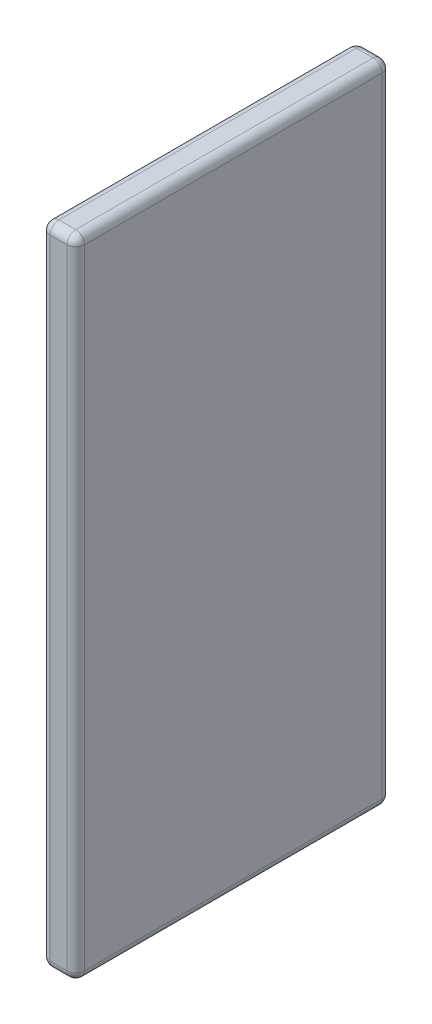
ISO-10303-21;
HEADER;
FILE_DESCRIPTION(('STEP AP214'),'2;1');
FILE_NAME('part.step','',(''),(''),'','','');
FILE_SCHEMA(('AUTOMOTIVE_DESIGN { 1 0 10303 214 1 1 1 1 }'));
ENDSEC;
DATA;
#1=APPLICATION_CONTEXT('core data for automotive mechanical design processes');
#2=APPLICATION_PROTOCOL_DEFINITION('international standard','automotive_design',2000,#1);
#3=PRODUCT_CONTEXT('',#1,'mechanical');
#4=PRODUCT('Part','Part','',(#3));
#5=PRODUCT_RELATED_PRODUCT_CATEGORY('part','',(#4));
#6=PRODUCT_DEFINITION_FORMATION('','',#4);
#7=PRODUCT_DEFINITION_CONTEXT('part definition',#1,'design');
#8=PRODUCT_DEFINITION('design','',#6,#7);
#9=PRODUCT_DEFINITION_SHAPE('','',#8);
#10=(LENGTH_UNIT() NAMED_UNIT(*) SI_UNIT(.MILLI.,.METRE.));
#11=(NAMED_UNIT(*) PLANE_ANGLE_UNIT() SI_UNIT($,.RADIAN.));
#12=(NAMED_UNIT(*) SI_UNIT($,.STERADIAN.) SOLID_ANGLE_UNIT());
#13=UNCERTAINTY_MEASURE_WITH_UNIT(LENGTH_MEASURE(1.E-05),#10,'distance_accuracy_value','');
#14=(GEOMETRIC_REPRESENTATION_CONTEXT(3) GLOBAL_UNCERTAINTY_ASSIGNED_CONTEXT((#13)) GLOBAL_UNIT_ASSIGNED_CONTEXT((#10,
#11,#12)) REPRESENTATION_CONTEXT('',''));
#15=CARTESIAN_POINT('',(0.,0.,0.));
#16=DIRECTION('',(0.,0.,1.));
#17=DIRECTION('',(1.,0.,0.));
#18=AXIS2_PLACEMENT_3D('',#15,#16,#17);
#19=CARTESIAN_POINT('',(7.8,0.,0.));
#20=DIRECTION('',(0.,0.,-1.));
#21=DIRECTION('',(-1.,0.,0.));
#22=AXIS2_PLACEMENT_3D('',#19,#20,#21);
#23=PLANE('',#22);
#24=DIRECTION('',(-1.,0.,0.));
#25=VECTOR('',#24,1.);
#26=CARTESIAN_POINT('',(7.8,2.,0.));
#27=LINE('',#26,#25);
#28=CARTESIAN_POINT('',(2.,2.,0.));
#29=VERTEX_POINT('',#28);
#30=CARTESIAN_POINT('',(5.8,2.,0.));
#31=VERTEX_POINT('',#30);
#32=EDGE_CURVE('E208',#29,#31,#27,.F.);
#33=ORIENTED_EDGE('',*,*,#32,.T.);
#34=DIRECTION('',(0.,-1.,0.));
#35=VECTOR('',#34,1.);
#36=CARTESIAN_POINT('',(5.8,0.,0.));
#37=LINE('',#36,#35);
#38=CARTESIAN_POINT('',(5.8,144.7,0.));
#39=VERTEX_POINT('',#38);
#40=EDGE_CURVE('E45',#31,#39,#37,.F.);
#41=ORIENTED_EDGE('',*,*,#40,.T.);
#42=DIRECTION('',(-1.,0.,0.));
#43=VECTOR('',#42,1.);
#44=CARTESIAN_POINT('',(7.8,144.7,0.));
#45=LINE('',#44,#43);
#46=CARTESIAN_POINT('',(2.,144.7,0.));
#47=VERTEX_POINT('',#46);
#48=EDGE_CURVE('E280',#39,#47,#45,.T.);
#49=ORIENTED_EDGE('',*,*,#48,.T.);
#50=DIRECTION('',(0.,-1.,0.));
#51=VECTOR('',#50,1.);
#52=CARTESIAN_POINT('',(2.,2.,0.));
#53=LINE('',#52,#51);
#54=EDGE_CURVE('E238',#47,#29,#53,.T.);
#55=ORIENTED_EDGE('',*,*,#54,.T.);
#56=EDGE_LOOP('',(#33,#41,#49,#55));
#57=FACE_BOUND('',#56,.T.);
#58=ADVANCED_FACE('F36',(#57),#23,.F.);
#59=CARTESIAN_POINT('',(7.8,0.,0.));
#60=DIRECTION('',(0.,1.,0.));
#61=DIRECTION('',(0.,0.,1.));
#62=AXIS2_PLACEMENT_3D('',#59,#60,#61);
#63=PLANE('',#62);
#64=DIRECTION('',(-1.,0.,0.));
#65=VECTOR('',#64,1.);
#66=CARTESIAN_POINT('',(7.8,0.,-69.5));
#67=LINE('',#66,#65);
#68=CARTESIAN_POINT('',(2.,0.,-69.5));
#69=VERTEX_POINT('',#68);
#70=CARTESIAN_POINT('',(5.8,0.,-69.5));
#71=VERTEX_POINT('',#70);
#72=EDGE_CURVE('E179',#69,#71,#67,.F.);
#73=ORIENTED_EDGE('',*,*,#72,.T.);
#74=DIRECTION('',(0.,0.,-1.));
#75=VECTOR('',#74,1.);
#76=CARTESIAN_POINT('',(5.8,0.,0.));
#77=LINE('',#76,#75);
#78=CARTESIAN_POINT('',(5.8,0.,-2.));
#79=VERTEX_POINT('',#78);
#80=EDGE_CURVE('E205',#71,#79,#77,.F.);
#81=ORIENTED_EDGE('',*,*,#80,.T.);
#82=DIRECTION('',(-1.,0.,0.));
#83=VECTOR('',#82,1.);
#84=CARTESIAN_POINT('',(7.8,0.,-2.));
#85=LINE('',#84,#83);
#86=CARTESIAN_POINT('',(2.,0.,-2.));
#87=VERTEX_POINT('',#86);
#88=EDGE_CURVE('E202',#79,#87,#85,.T.);
#89=ORIENTED_EDGE('',*,*,#88,.T.);
#90=DIRECTION('',(0.,0.,-1.));
#91=VECTOR('',#90,1.);
#92=CARTESIAN_POINT('',(2.,0.,-69.5));
#93=LINE('',#92,#91);
#94=EDGE_CURVE('E200',#87,#69,#93,.T.);
#95=ORIENTED_EDGE('',*,*,#94,.T.);
#96=EDGE_LOOP('',(#73,#81,#89,#95));
#97=FACE_BOUND('',#96,.T.);
#98=ADVANCED_FACE('F261',(#97),#63,.F.);
#99=CARTESIAN_POINT('',(7.8,0.,-71.5));
#100=DIRECTION('',(0.,0.,1.));
#101=DIRECTION('',(1.,0.,0.));
#102=AXIS2_PLACEMENT_3D('',#99,#100,#101);
#103=PLANE('',#102);
#104=DIRECTION('',(-1.,0.,0.));
#105=VECTOR('',#104,1.);
#106=CARTESIAN_POINT('',(7.8,144.7,-71.5));
#107=LINE('',#106,#105);
#108=CARTESIAN_POINT('',(2.,144.7,-71.5));
#109=VERTEX_POINT('',#108);
#110=CARTESIAN_POINT('',(5.8,144.7,-71.5));
#111=VERTEX_POINT('',#110);
#112=EDGE_CURVE('E136',#109,#111,#107,.F.);
#113=ORIENTED_EDGE('',*,*,#112,.T.);
#114=DIRECTION('',(0.,1.,0.));
#115=VECTOR('',#114,1.);
#116=CARTESIAN_POINT('',(5.8,0.,-71.5));
#117=LINE('',#116,#115);
#118=CARTESIAN_POINT('',(5.8,2.,-71.5));
#119=VERTEX_POINT('',#118);
#120=EDGE_CURVE('E176',#111,#119,#117,.F.);
#121=ORIENTED_EDGE('',*,*,#120,.T.);
#122=DIRECTION('',(-1.,0.,0.));
#123=VECTOR('',#122,1.);
#124=CARTESIAN_POINT('',(7.8,2.,-71.5));
#125=LINE('',#124,#123);
#126=CARTESIAN_POINT('',(2.,2.,-71.5));
#127=VERTEX_POINT('',#126);
#128=EDGE_CURVE('E169',#119,#127,#125,.T.);
#129=ORIENTED_EDGE('',*,*,#128,.T.);
#130=DIRECTION('',(0.,1.,0.));
#131=VECTOR('',#130,1.);
#132=CARTESIAN_POINT('',(2.,144.7,-71.5));
#133=LINE('',#132,#131);
#134=EDGE_CURVE('E166',#127,#109,#133,.T.);
#135=ORIENTED_EDGE('',*,*,#134,.T.);
#136=EDGE_LOOP('',(#113,#121,#129,#135));
#137=FACE_BOUND('',#136,.T.);
#138=ADVANCED_FACE('F275',(#137),#103,.F.);
#139=CARTESIAN_POINT('',(7.8,146.7,0.));
#140=DIRECTION('',(0.,-1.,0.));
#141=DIRECTION('',(0.,0.,-1.));
#142=AXIS2_PLACEMENT_3D('',#139,#140,#141);
#143=PLANE('',#142);
#144=DIRECTION('',(0.,0.,1.));
#145=VECTOR('',#144,1.);
#146=CARTESIAN_POINT('',(5.8,146.7,0.));
#147=LINE('',#146,#145);
#148=CARTESIAN_POINT('',(5.8,146.7,-2.));
#149=VERTEX_POINT('',#148);
#150=CARTESIAN_POINT('',(5.8,146.7,-69.5));
#151=VERTEX_POINT('',#150);
#152=EDGE_CURVE('E162',#149,#151,#147,.F.);
#153=ORIENTED_EDGE('',*,*,#152,.T.);
#154=DIRECTION('',(-1.,0.,0.));
#155=VECTOR('',#154,1.);
#156=CARTESIAN_POINT('',(7.8,146.7,-69.5));
#157=LINE('',#156,#155);
#158=CARTESIAN_POINT('',(2.,146.7,-69.5));
#159=VERTEX_POINT('',#158);
#160=EDGE_CURVE('E133',#151,#159,#157,.T.);
#161=ORIENTED_EDGE('',*,*,#160,.T.);
#162=DIRECTION('',(0.,0.,1.));
#163=VECTOR('',#162,1.);
#164=CARTESIAN_POINT('',(2.,146.7,0.));
#165=LINE('',#164,#163);
#166=CARTESIAN_POINT('',(2.,146.7,-2.));
#167=VERTEX_POINT('',#166);
#168=EDGE_CURVE('E148',#159,#167,#165,.T.);
#169=ORIENTED_EDGE('',*,*,#168,.T.);
#170=DIRECTION('',(-1.,0.,0.));
#171=VECTOR('',#170,1.);
#172=CARTESIAN_POINT('',(7.8,146.7,-2.));
#173=LINE('',#172,#171);
#174=EDGE_CURVE('E156',#167,#149,#173,.F.);
#175=ORIENTED_EDGE('',*,*,#174,.T.);
#176=EDGE_LOOP('',(#153,#161,#169,#175));
#177=FACE_BOUND('',#176,.T.);
#178=ADVANCED_FACE('F160',(#177),#143,.F.);
#179=CARTESIAN_POINT('',(7.8,0.,0.));
#180=DIRECTION('',(-1.,0.,0.));
#181=DIRECTION('',(0.,0.,1.));
#182=AXIS2_PLACEMENT_3D('',#179,#180,#181);
#183=PLANE('',#182);
#184=DIRECTION('',(0.,0.,1.));
#185=VECTOR('',#184,1.);
#186=CARTESIAN_POINT('',(7.8,144.7,0.));
#187=LINE('',#186,#185);
#188=CARTESIAN_POINT('',(7.8,144.7,-69.5));
#189=VERTEX_POINT('',#188);
#190=CARTESIAN_POINT('',(7.8,144.7,-2.));
#191=VERTEX_POINT('',#190);
#192=EDGE_CURVE('E283',#189,#191,#187,.T.);
#193=ORIENTED_EDGE('',*,*,#192,.T.);
#194=DIRECTION('',(0.,-1.,0.));
#195=VECTOR('',#194,1.);
#196=CARTESIAN_POINT('',(7.8,0.,-2.));
#197=LINE('',#196,#195);
#198=CARTESIAN_POINT('',(7.8,2.,-2.));
#199=VERTEX_POINT('',#198);
#200=EDGE_CURVE('E236',#191,#199,#197,.T.);
#201=ORIENTED_EDGE('',*,*,#200,.T.);
#202=DIRECTION('',(0.,0.,-1.));
#203=VECTOR('',#202,1.);
#204=CARTESIAN_POINT('',(7.8,2.,0.));
#205=LINE('',#204,#203);
#206=CARTESIAN_POINT('',(7.8,2.,-69.5));
#207=VERTEX_POINT('',#206);
#208=EDGE_CURVE('E211',#199,#207,#205,.T.);
#209=ORIENTED_EDGE('',*,*,#208,.T.);
#210=DIRECTION('',(0.,1.,0.));
#211=VECTOR('',#210,1.);
#212=CARTESIAN_POINT('',(7.8,0.,-69.5));
#213=LINE('',#212,#211);
#214=EDGE_CURVE('E182',#207,#189,#213,.T.);
#215=ORIENTED_EDGE('',*,*,#214,.T.);
#216=EDGE_LOOP('',(#193,#201,#209,#215));
#217=FACE_BOUND('',#216,.T.);
#218=ADVANCED_FACE('F308',(#217),#183,.F.);
#219=CARTESIAN_POINT('',(0.,0.,0.));
#220=DIRECTION('',(-1.,0.,0.));
#221=DIRECTION('',(0.,0.,1.));
#222=AXIS2_PLACEMENT_3D('',#219,#220,#221);
#223=PLANE('',#222);
#224=DIRECTION('',(0.,0.,-1.));
#225=VECTOR('',#224,1.);
#226=CARTESIAN_POINT('',(0.,2.,0.));
#227=LINE('',#226,#225);
#228=CARTESIAN_POINT('',(0.,2.,-69.5));
#229=VERTEX_POINT('',#228);
#230=CARTESIAN_POINT('',(0.,2.,-2.));
#231=VERTEX_POINT('',#230);
#232=EDGE_CURVE('E213',#229,#231,#227,.F.);
#233=ORIENTED_EDGE('',*,*,#232,.T.);
#234=DIRECTION('',(0.,-1.,0.));
#235=VECTOR('',#234,1.);
#236=CARTESIAN_POINT('',(0.,144.7,-2.));
#237=LINE('',#236,#235);
#238=CARTESIAN_POINT('',(0.,144.7,-2.));
#239=VERTEX_POINT('',#238);
#240=EDGE_CURVE('E11',#231,#239,#237,.F.);
#241=ORIENTED_EDGE('',*,*,#240,.T.);
#242=DIRECTION('',(0.,0.,1.));
#243=VECTOR('',#242,1.);
#244=CARTESIAN_POINT('',(0.,144.7,-71.5));
#245=LINE('',#244,#243);
#246=CARTESIAN_POINT('',(0.,144.7,-69.5));
#247=VERTEX_POINT('',#246);
#248=EDGE_CURVE('E142',#239,#247,#245,.F.);
#249=ORIENTED_EDGE('',*,*,#248,.T.);
#250=DIRECTION('',(0.,1.,0.));
#251=VECTOR('',#250,1.);
#252=CARTESIAN_POINT('',(0.,0.,-69.5));
#253=LINE('',#252,#251);
#254=EDGE_CURVE('E184',#247,#229,#253,.F.);
#255=ORIENTED_EDGE('',*,*,#254,.T.);
#256=EDGE_LOOP('',(#233,#241,#249,#255));
#257=FACE_BOUND('',#256,.T.);
#258=ADVANCED_FACE('F279',(#257),#223,.T.);
#259=CARTESIAN_POINT('',(7.8,144.7,-2.));
#260=DIRECTION('',(-1.,0.,0.));
#261=DIRECTION('',(0.,0.,1.));
#262=AXIS2_PLACEMENT_3D('',#259,#260,#261);
#263=CYLINDRICAL_SURFACE('',#262,2.);
#264=ORIENTED_EDGE('',*,*,#48,.F.);
#265=CARTESIAN_POINT('',(5.8,144.7,-2.));
#266=DIRECTION('',(-1.,0.,0.));
#267=DIRECTION('',(0.,0.,1.));
#268=AXIS2_PLACEMENT_3D('',#265,#266,#267);
#269=CIRCLE('',#268,2.);
#270=EDGE_CURVE('E226',#39,#149,#269,.T.);
#271=ORIENTED_EDGE('',*,*,#270,.T.);
#272=ORIENTED_EDGE('',*,*,#174,.F.);
#273=CARTESIAN_POINT('',(2.,144.7,-2.));
#274=DIRECTION('',(-1.,0.,0.));
#275=DIRECTION('',(0.,0.,1.));
#276=AXIS2_PLACEMENT_3D('',#273,#274,#275);
#277=CIRCLE('',#276,2.);
#278=EDGE_CURVE('E224',#167,#47,#277,.F.);
#279=ORIENTED_EDGE('',*,*,#278,.T.);
#280=EDGE_LOOP('',(#264,#271,#272,#279));
#281=FACE_BOUND('',#280,.T.);
#282=ADVANCED_FACE('F319',(#281),#263,.T.);
#283=CARTESIAN_POINT('',(5.8,144.7,0.));
#284=DIRECTION('',(0.,0.,1.));
#285=DIRECTION('',(1.,0.,0.));
#286=AXIS2_PLACEMENT_3D('',#283,#284,#285);
#287=CYLINDRICAL_SURFACE('',#286,2.);
#288=ORIENTED_EDGE('',*,*,#152,.F.);
#289=CARTESIAN_POINT('',(5.8,144.7,-2.));
#290=DIRECTION('',(0.,0.,1.));
#291=DIRECTION('',(1.,0.,0.));
#292=AXIS2_PLACEMENT_3D('',#289,#290,#291);
#293=CIRCLE('',#292,2.);
#294=EDGE_CURVE('E215',#149,#191,#293,.F.);
#295=ORIENTED_EDGE('',*,*,#294,.T.);
#296=ORIENTED_EDGE('',*,*,#192,.F.);
#297=CARTESIAN_POINT('',(5.8,144.7,-69.5));
#298=DIRECTION('',(0.,0.,1.));
#299=DIRECTION('',(1.,0.,0.));
#300=AXIS2_PLACEMENT_3D('',#297,#298,#299);
#301=CIRCLE('',#300,2.);
#302=EDGE_CURVE('E167',#189,#151,#301,.T.);
#303=ORIENTED_EDGE('',*,*,#302,.T.);
#304=EDGE_LOOP('',(#288,#295,#296,#303));
#305=FACE_BOUND('',#304,.T.);
#306=ADVANCED_FACE('F295',(#305),#287,.T.);
#307=CARTESIAN_POINT('',(2.,144.7,0.));
#308=DIRECTION('',(0.,0.,-1.));
#309=DIRECTION('',(-1.,0.,0.));
#310=AXIS2_PLACEMENT_3D('',#307,#308,#309);
#311=CYLINDRICAL_SURFACE('',#310,2.);
#312=ORIENTED_EDGE('',*,*,#248,.F.);
#313=CARTESIAN_POINT('',(2.,144.7,-2.));
#314=DIRECTION('',(0.,0.,-1.));
#315=DIRECTION('',(-1.,0.,0.));
#316=AXIS2_PLACEMENT_3D('',#313,#314,#315);
#317=CIRCLE('',#316,2.);
#318=EDGE_CURVE('E152',#239,#167,#317,.T.);
#319=ORIENTED_EDGE('',*,*,#318,.T.);
#320=ORIENTED_EDGE('',*,*,#168,.F.);
#321=CARTESIAN_POINT('',(2.,144.7,-69.5));
#322=DIRECTION('',(0.,0.,-1.));
#323=DIRECTION('',(-1.,0.,0.));
#324=AXIS2_PLACEMENT_3D('',#321,#322,#323);
#325=CIRCLE('',#324,2.);
#326=EDGE_CURVE('E150',#159,#247,#325,.F.);
#327=ORIENTED_EDGE('',*,*,#326,.T.);
#328=EDGE_LOOP('',(#312,#319,#320,#327));
#329=FACE_BOUND('',#328,.T.);
#330=ADVANCED_FACE('F149',(#329),#311,.T.);
#331=CARTESIAN_POINT('',(7.8,144.7,-69.5));
#332=DIRECTION('',(-1.,0.,0.));
#333=DIRECTION('',(0.,0.,1.));
#334=AXIS2_PLACEMENT_3D('',#331,#332,#333);
#335=CYLINDRICAL_SURFACE('',#334,2.);
#336=ORIENTED_EDGE('',*,*,#160,.F.);
#337=CARTESIAN_POINT('',(5.8,144.7,-69.5));
#338=DIRECTION('',(-1.,0.,0.));
#339=DIRECTION('',(0.,0.,1.));
#340=AXIS2_PLACEMENT_3D('',#337,#338,#339);
#341=CIRCLE('',#340,2.);
#342=EDGE_CURVE('E141',#151,#111,#341,.T.);
#343=ORIENTED_EDGE('',*,*,#342,.T.);
#344=ORIENTED_EDGE('',*,*,#112,.F.);
#345=CARTESIAN_POINT('',(2.,144.7,-69.5));
#346=DIRECTION('',(-1.,0.,0.));
#347=DIRECTION('',(0.,0.,1.));
#348=AXIS2_PLACEMENT_3D('',#345,#346,#347);
#349=CIRCLE('',#348,2.);
#350=EDGE_CURVE('E128',#109,#159,#349,.F.);
#351=ORIENTED_EDGE('',*,*,#350,.T.);
#352=EDGE_LOOP('',(#336,#343,#344,#351));
#353=FACE_BOUND('',#352,.T.);
#354=ADVANCED_FACE('F130',(#353),#335,.T.);
#355=CARTESIAN_POINT('',(2.,144.7,-69.5));
#356=DIRECTION('',(0.,0.,1.));
#357=DIRECTION('',(1.,0.,0.));
#358=AXIS2_PLACEMENT_3D('',#355,#356,#357);
#359=SPHERICAL_SURFACE('',#358,2.);
#360=ORIENTED_EDGE('',*,*,#326,.F.);
#361=ORIENTED_EDGE('',*,*,#350,.F.);
#362=CARTESIAN_POINT('',(2.,144.7,-69.5));
#363=DIRECTION('',(0.,-1.,0.));
#364=DIRECTION('',(0.,0.,-1.));
#365=AXIS2_PLACEMENT_3D('',#362,#363,#364);
#366=CIRCLE('',#365,2.);
#367=EDGE_CURVE('E157',#247,#109,#366,.T.);
#368=ORIENTED_EDGE('',*,*,#367,.F.);
#369=EDGE_LOOP('',(#360,#361,#368));
#370=FACE_BOUND('',#369,.T.);
#371=ADVANCED_FACE('F164',(#370),#359,.T.);
#372=CARTESIAN_POINT('',(2.,0.,-69.5));
#373=DIRECTION('',(0.,-1.,0.));
#374=DIRECTION('',(0.,0.,-1.));
#375=AXIS2_PLACEMENT_3D('',#372,#373,#374);
#376=CYLINDRICAL_SURFACE('',#375,2.);
#377=ORIENTED_EDGE('',*,*,#134,.F.);
#378=CARTESIAN_POINT('',(2.,2.,-69.5));
#379=DIRECTION('',(0.,-1.,0.));
#380=DIRECTION('',(0.,0.,-1.));
#381=AXIS2_PLACEMENT_3D('',#378,#379,#380);
#382=CIRCLE('',#381,2.);
#383=EDGE_CURVE('E198',#127,#229,#382,.F.);
#384=ORIENTED_EDGE('',*,*,#383,.T.);
#385=ORIENTED_EDGE('',*,*,#254,.F.);
#386=ORIENTED_EDGE('',*,*,#367,.T.);
#387=EDGE_LOOP('',(#377,#384,#385,#386));
#388=FACE_BOUND('',#387,.T.);
#389=ADVANCED_FACE('F278',(#388),#376,.T.);
#390=CARTESIAN_POINT('',(7.8,2.,-69.5));
#391=DIRECTION('',(-1.,0.,0.));
#392=DIRECTION('',(0.,0.,1.));
#393=AXIS2_PLACEMENT_3D('',#390,#391,#392);
#394=CYLINDRICAL_SURFACE('',#393,2.);
#395=ORIENTED_EDGE('',*,*,#128,.F.);
#396=CARTESIAN_POINT('',(5.8,2.,-69.5));
#397=DIRECTION('',(-1.,0.,0.));
#398=DIRECTION('',(0.,0.,1.));
#399=AXIS2_PLACEMENT_3D('',#396,#397,#398);
#400=CIRCLE('',#399,2.);
#401=EDGE_CURVE('E196',#119,#71,#400,.T.);
#402=ORIENTED_EDGE('',*,*,#401,.T.);
#403=ORIENTED_EDGE('',*,*,#72,.F.);
#404=CARTESIAN_POINT('',(2.,2.,-69.5));
#405=DIRECTION('',(-1.,0.,0.));
#406=DIRECTION('',(0.,0.,1.));
#407=AXIS2_PLACEMENT_3D('',#404,#405,#406);
#408=CIRCLE('',#407,2.);
#409=EDGE_CURVE('E194',#69,#127,#408,.F.);
#410=ORIENTED_EDGE('',*,*,#409,.T.);
#411=EDGE_LOOP('',(#395,#402,#403,#410));
#412=FACE_BOUND('',#411,.T.);
#413=ADVANCED_FACE('F272',(#412),#394,.T.);
#414=CARTESIAN_POINT('',(5.8,0.,-69.5));
#415=DIRECTION('',(0.,1.,0.));
#416=DIRECTION('',(0.,0.,1.));
#417=AXIS2_PLACEMENT_3D('',#414,#415,#416);
#418=CYLINDRICAL_SURFACE('',#417,2.);
#419=ORIENTED_EDGE('',*,*,#214,.F.);
#420=CARTESIAN_POINT('',(5.8,2.,-69.5));
#421=DIRECTION('',(0.,1.,0.));
#422=DIRECTION('',(0.,0.,1.));
#423=AXIS2_PLACEMENT_3D('',#420,#421,#422);
#424=CIRCLE('',#423,2.);
#425=EDGE_CURVE('E187',#207,#119,#424,.T.);
#426=ORIENTED_EDGE('',*,*,#425,.T.);
#427=ORIENTED_EDGE('',*,*,#120,.F.);
#428=CARTESIAN_POINT('',(5.8,144.7,-69.5));
#429=DIRECTION('',(0.,1.,0.));
#430=DIRECTION('',(0.,0.,1.));
#431=AXIS2_PLACEMENT_3D('',#428,#429,#430);
#432=CIRCLE('',#431,2.);
#433=EDGE_CURVE('E188',#189,#111,#432,.T.);
#434=ORIENTED_EDGE('',*,*,#433,.F.);
#435=EDGE_LOOP('',(#419,#426,#427,#434));
#436=FACE_BOUND('',#435,.T.);
#437=ADVANCED_FACE('F346',(#436),#418,.T.);
#438=CARTESIAN_POINT('',(5.8,144.7,-69.5));
#439=DIRECTION('',(0.,0.,1.));
#440=DIRECTION('',(1.,0.,0.));
#441=AXIS2_PLACEMENT_3D('',#438,#439,#440);
#442=SPHERICAL_SURFACE('',#441,2.);
#443=ORIENTED_EDGE('',*,*,#342,.F.);
#444=ORIENTED_EDGE('',*,*,#302,.F.);
#445=ORIENTED_EDGE('',*,*,#433,.T.);
#446=EDGE_LOOP('',(#443,#444,#445));
#447=FACE_BOUND('',#446,.T.);
#448=ADVANCED_FACE('F343',(#447),#442,.T.);
#449=CARTESIAN_POINT('',(2.,2.,-69.5));
#450=DIRECTION('',(0.,0.,1.));
#451=DIRECTION('',(1.,0.,0.));
#452=AXIS2_PLACEMENT_3D('',#449,#450,#451);
#453=SPHERICAL_SURFACE('',#452,2.);
#454=ORIENTED_EDGE('',*,*,#383,.F.);
#455=ORIENTED_EDGE('',*,*,#409,.F.);
#456=CARTESIAN_POINT('',(2.,2.,-69.5));
#457=DIRECTION('',(0.,0.,1.));
#458=DIRECTION('',(1.,0.,0.));
#459=AXIS2_PLACEMENT_3D('',#456,#457,#458);
#460=CIRCLE('',#459,2.);
#461=EDGE_CURVE('E190',#229,#69,#460,.T.);
#462=ORIENTED_EDGE('',*,*,#461,.F.);
#463=EDGE_LOOP('',(#454,#455,#462));
#464=FACE_BOUND('',#463,.T.);
#465=ADVANCED_FACE('F269',(#464),#453,.T.);
#466=CARTESIAN_POINT('',(2.,2.,0.));
#467=DIRECTION('',(0.,0.,1.));
#468=DIRECTION('',(1.,0.,0.));
#469=AXIS2_PLACEMENT_3D('',#466,#467,#468);
#470=CYLINDRICAL_SURFACE('',#469,2.);
#471=ORIENTED_EDGE('',*,*,#94,.F.);
#472=CARTESIAN_POINT('',(2.,2.,-2.));
#473=DIRECTION('',(0.,0.,1.));
#474=DIRECTION('',(1.,0.,0.));
#475=AXIS2_PLACEMENT_3D('',#472,#473,#474);
#476=CIRCLE('',#475,2.);
#477=EDGE_CURVE('E53',#87,#231,#476,.F.);
#478=ORIENTED_EDGE('',*,*,#477,.T.);
#479=ORIENTED_EDGE('',*,*,#232,.F.);
#480=ORIENTED_EDGE('',*,*,#461,.T.);
#481=EDGE_LOOP('',(#471,#478,#479,#480));
#482=FACE_BOUND('',#481,.T.);
#483=ADVANCED_FACE('F264',(#482),#470,.T.);
#484=CARTESIAN_POINT('',(7.8,2.,-2.));
#485=DIRECTION('',(-1.,0.,0.));
#486=DIRECTION('',(0.,0.,1.));
#487=AXIS2_PLACEMENT_3D('',#484,#485,#486);
#488=CYLINDRICAL_SURFACE('',#487,2.);
#489=ORIENTED_EDGE('',*,*,#88,.F.);
#490=CARTESIAN_POINT('',(5.8,2.,-2.));
#491=DIRECTION('',(-1.,0.,0.));
#492=DIRECTION('',(0.,0.,1.));
#493=AXIS2_PLACEMENT_3D('',#490,#491,#492);
#494=CIRCLE('',#493,2.);
#495=EDGE_CURVE('E232',#79,#31,#494,.T.);
#496=ORIENTED_EDGE('',*,*,#495,.T.);
#497=ORIENTED_EDGE('',*,*,#32,.F.);
#498=CARTESIAN_POINT('',(2.,2.,-2.));
#499=DIRECTION('',(-1.,0.,0.));
#500=DIRECTION('',(0.,0.,1.));
#501=AXIS2_PLACEMENT_3D('',#498,#499,#500);
#502=CIRCLE('',#501,2.);
#503=EDGE_CURVE('E230',#29,#87,#502,.F.);
#504=ORIENTED_EDGE('',*,*,#503,.T.);
#505=EDGE_LOOP('',(#489,#496,#497,#504));
#506=FACE_BOUND('',#505,.T.);
#507=ADVANCED_FACE('F258',(#506),#488,.T.);
#508=CARTESIAN_POINT('',(5.8,2.,0.));
#509=DIRECTION('',(0.,0.,-1.));
#510=DIRECTION('',(-1.,0.,0.));
#511=AXIS2_PLACEMENT_3D('',#508,#509,#510);
#512=CYLINDRICAL_SURFACE('',#511,2.);
#513=ORIENTED_EDGE('',*,*,#208,.F.);
#514=CARTESIAN_POINT('',(5.8,2.,-2.));
#515=DIRECTION('',(0.,0.,-1.));
#516=DIRECTION('',(-1.,0.,0.));
#517=AXIS2_PLACEMENT_3D('',#514,#515,#516);
#518=CIRCLE('',#517,2.);
#519=EDGE_CURVE('E228',#199,#79,#518,.T.);
#520=ORIENTED_EDGE('',*,*,#519,.T.);
#521=ORIENTED_EDGE('',*,*,#80,.F.);
#522=CARTESIAN_POINT('',(5.8,2.,-69.5));
#523=DIRECTION('',(0.,0.,-1.));
#524=DIRECTION('',(-1.,0.,0.));
#525=AXIS2_PLACEMENT_3D('',#522,#523,#524);
#526=CIRCLE('',#525,2.);
#527=EDGE_CURVE('E216',#207,#71,#526,.T.);
#528=ORIENTED_EDGE('',*,*,#527,.F.);
#529=EDGE_LOOP('',(#513,#520,#521,#528));
#530=FACE_BOUND('',#529,.T.);
#531=ADVANCED_FACE('F313',(#530),#512,.T.);
#532=CARTESIAN_POINT('',(5.8,2.,-69.5));
#533=DIRECTION('',(0.,0.,1.));
#534=DIRECTION('',(1.,0.,0.));
#535=AXIS2_PLACEMENT_3D('',#532,#533,#534);
#536=SPHERICAL_SURFACE('',#535,2.);
#537=ORIENTED_EDGE('',*,*,#527,.T.);
#538=ORIENTED_EDGE('',*,*,#401,.F.);
#539=ORIENTED_EDGE('',*,*,#425,.F.);
#540=EDGE_LOOP('',(#537,#538,#539));
#541=FACE_BOUND('',#540,.T.);
#542=ADVANCED_FACE('F356',(#541),#536,.T.);
#543=CARTESIAN_POINT('',(5.8,2.,-2.));
#544=DIRECTION('',(0.,0.,1.));
#545=DIRECTION('',(1.,0.,0.));
#546=AXIS2_PLACEMENT_3D('',#543,#544,#545);
#547=SPHERICAL_SURFACE('',#546,2.);
#548=ORIENTED_EDGE('',*,*,#495,.F.);
#549=ORIENTED_EDGE('',*,*,#519,.F.);
#550=CARTESIAN_POINT('',(5.8,2.,-2.));
#551=DIRECTION('',(0.,1.,0.));
#552=DIRECTION('',(0.,0.,1.));
#553=AXIS2_PLACEMENT_3D('',#550,#551,#552);
#554=CIRCLE('',#553,2.);
#555=EDGE_CURVE('E219',#31,#199,#554,.T.);
#556=ORIENTED_EDGE('',*,*,#555,.F.);
#557=EDGE_LOOP('',(#548,#549,#556));
#558=FACE_BOUND('',#557,.T.);
#559=ADVANCED_FACE('F316',(#558),#547,.T.);
#560=CARTESIAN_POINT('',(5.8,0.,-2.));
#561=DIRECTION('',(0.,-1.,0.));
#562=DIRECTION('',(0.,0.,-1.));
#563=AXIS2_PLACEMENT_3D('',#560,#561,#562);
#564=CYLINDRICAL_SURFACE('',#563,2.);
#565=ORIENTED_EDGE('',*,*,#555,.T.);
#566=ORIENTED_EDGE('',*,*,#200,.F.);
#567=CARTESIAN_POINT('',(5.8,144.7,-2.));
#568=DIRECTION('',(0.,1.,0.));
#569=DIRECTION('',(0.,0.,1.));
#570=AXIS2_PLACEMENT_3D('',#567,#568,#569);
#571=CIRCLE('',#570,2.);
#572=EDGE_CURVE('E241',#39,#191,#571,.T.);
#573=ORIENTED_EDGE('',*,*,#572,.F.);
#574=ORIENTED_EDGE('',*,*,#40,.F.);
#575=EDGE_LOOP('',(#565,#566,#573,#574));
#576=FACE_BOUND('',#575,.T.);
#577=ADVANCED_FACE('F304',(#576),#564,.T.);
#578=CARTESIAN_POINT('',(5.8,144.7,-2.));
#579=DIRECTION('',(0.,0.,1.));
#580=DIRECTION('',(1.,0.,0.));
#581=AXIS2_PLACEMENT_3D('',#578,#579,#580);
#582=SPHERICAL_SURFACE('',#581,2.);
#583=ORIENTED_EDGE('',*,*,#294,.F.);
#584=ORIENTED_EDGE('',*,*,#270,.F.);
#585=ORIENTED_EDGE('',*,*,#572,.T.);
#586=EDGE_LOOP('',(#583,#584,#585));
#587=FACE_BOUND('',#586,.T.);
#588=ADVANCED_FACE('F299',(#587),#582,.T.);
#589=CARTESIAN_POINT('',(2.,2.,-2.));
#590=DIRECTION('',(0.,0.,1.));
#591=DIRECTION('',(1.,0.,0.));
#592=AXIS2_PLACEMENT_3D('',#589,#590,#591);
#593=SPHERICAL_SURFACE('',#592,2.);
#594=ORIENTED_EDGE('',*,*,#477,.F.);
#595=ORIENTED_EDGE('',*,*,#503,.F.);
#596=CARTESIAN_POINT('',(2.,2.,-2.));
#597=DIRECTION('',(0.,1.,0.));
#598=DIRECTION('',(0.,0.,1.));
#599=AXIS2_PLACEMENT_3D('',#596,#597,#598);
#600=CIRCLE('',#599,2.);
#601=EDGE_CURVE('E40',#231,#29,#600,.T.);
#602=ORIENTED_EDGE('',*,*,#601,.F.);
#603=EDGE_LOOP('',(#594,#595,#602));
#604=FACE_BOUND('',#603,.T.);
#605=ADVANCED_FACE('F38',(#604),#593,.T.);
#606=CARTESIAN_POINT('',(2.,0.,-2.));
#607=DIRECTION('',(0.,1.,0.));
#608=DIRECTION('',(0.,0.,1.));
#609=AXIS2_PLACEMENT_3D('',#606,#607,#608);
#610=CYLINDRICAL_SURFACE('',#609,2.);
#611=ORIENTED_EDGE('',*,*,#601,.T.);
#612=ORIENTED_EDGE('',*,*,#54,.F.);
#613=CARTESIAN_POINT('',(2.,144.7,-2.));
#614=DIRECTION('',(0.,1.,0.));
#615=DIRECTION('',(0.,0.,1.));
#616=AXIS2_PLACEMENT_3D('',#613,#614,#615);
#617=CIRCLE('',#616,2.);
#618=EDGE_CURVE('E244',#239,#47,#617,.T.);
#619=ORIENTED_EDGE('',*,*,#618,.F.);
#620=ORIENTED_EDGE('',*,*,#240,.F.);
#621=EDGE_LOOP('',(#611,#612,#619,#620));
#622=FACE_BOUND('',#621,.T.);
#623=ADVANCED_FACE('F252',(#622),#610,.T.);
#624=CARTESIAN_POINT('',(2.,144.7,-2.));
#625=DIRECTION('',(0.,0.,1.));
#626=DIRECTION('',(1.,0.,0.));
#627=AXIS2_PLACEMENT_3D('',#624,#625,#626);
#628=SPHERICAL_SURFACE('',#627,2.);
#629=ORIENTED_EDGE('',*,*,#618,.T.);
#630=ORIENTED_EDGE('',*,*,#278,.F.);
#631=ORIENTED_EDGE('',*,*,#318,.F.);
#632=EDGE_LOOP('',(#629,#630,#631));
#633=FACE_BOUND('',#632,.T.);
#634=ADVANCED_FACE('F320',(#633),#628,.T.);
#635=CLOSED_SHELL('',(#58,#98,#138,#178,#218,#258,#282,#306,#330,#354,#371,#389,#413,#437,#448,
#465,#483,#507,#531,#542,#559,#577,#588,#605,#623,#634));
#636=MANIFOLD_SOLID_BREP('B2',#635);
#637=ADVANCED_BREP_SHAPE_REPRESENTATION('',(#18,#636),#14);
#638=SHAPE_DEFINITION_REPRESENTATION(#9,#637);
ENDSEC;
END-ISO-10303-21;
